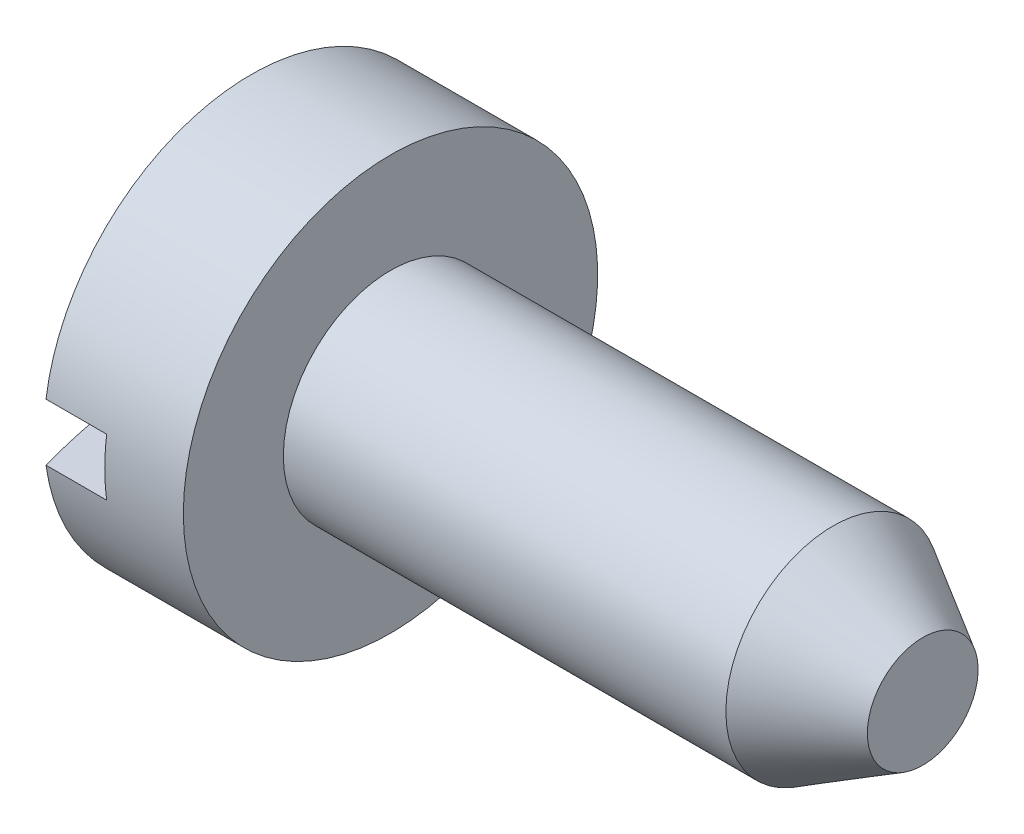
from build123d import *

# Parameters (mm, degrees)
SLOT_CUT_EXTRUDE1_DEPTH      = 6.209910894
SLOT_CUT_EXTRUDE1_DEPTH_BACK = 6.209910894
SKETCH2_W                    = 0.635
SKETCH2_H                    = 0.4064


with BuildPart() as part:
    # Sketch1 → base-Revolve (revolve)
    with BuildSketch(Plane.XY, mode=Mode.PRIVATE) as base_revolve_sk:
        with BuildLine():
            Line((0.9906, 0.762), (0.9906, 1.4732))
            Line((0.9906, 1.4732), (0, 1.4732))
            ThreePointArc((0, 1.4732), (-0.152160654, 0.743573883), (-0.2032, 0))
            Line((-0.2032, 0), (0, 0))
            Line((0, 0), (4.7752, 0))
            Line((4.7752, 0), (4.7752, 0.762))
            Line((4.7752, 0.762), (0.9906, 0.762))
        make_face()
    revolve(base_revolve_sk.sketch.rotate(Axis((0, 0, 0), (1, 0, 0)), 90), axis=Axis((0, 0, 0), (1, 0, 0)))

    # Sketch2 → slot_Cut-Extrude1 (cut, two sides: drawn at the far end of the back side and taken through both)
    with BuildSketch(Plane.XY.offset(-SLOT_CUT_EXTRUDE1_DEPTH_BACK)):
        with Locations((0.1143, 0)):
            Rectangle(SKETCH2_W, SKETCH2_H)
    extrude(amount=SLOT_CUT_EXTRUDE1_DEPTH + SLOT_CUT_EXTRUDE1_DEPTH_BACK, mode=Mode.SUBTRACT)

    # Sketch8 → point_Cut-Revolve1 (revolve, cut)
    with BuildSketch(Plane.XY, mode=Mode.PRIVATE) as point_cut_revolve1_sk:
        Polygon((4.7752, 0), (5.2832, 0), (5.2832, 1.27), (4.137285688, 1.27), (4.137285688, 0.762), (4.7752, 0.3937), align=None)
    revolve(point_cut_revolve1_sk.sketch.rotate(Axis((0, 0, 0), (1, 0, 0)), 90), axis=Axis((0, 0, 0), (1, 0, 0)), mode=Mode.SUBTRACT)


solid = part.part
